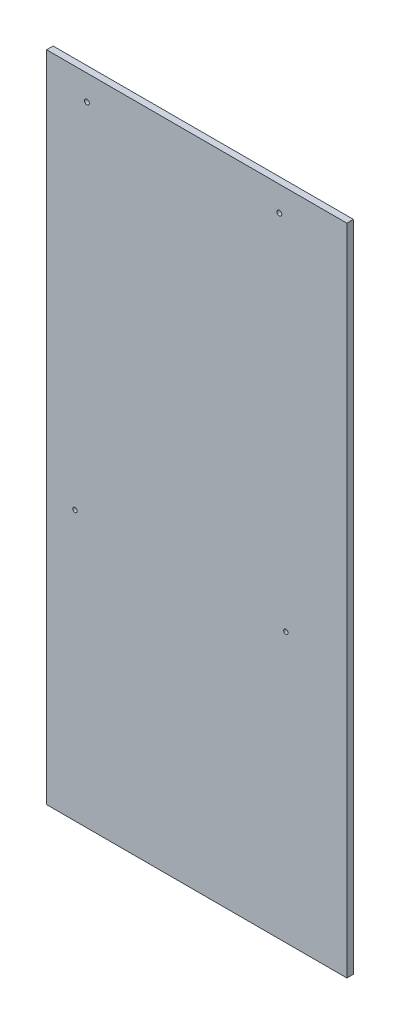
from build123d import *

# Parameters (mm, degrees)
SKETCH2_W           = 350.012
SKETCH2_H           = 762
BOSS_EXTRUDE2_DEPTH = 7.62
SKETCH3_R           = 2.8575
CUT_EXTRUDE1_DEPTH  = 7.62
SKETCH4_R           = 2.54
CUT_EXTRUDE2_DEPTH  = 420.340153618
SKETCH5_R           = 2.54
CUT_EXTRUDE3_DEPTH  = 420.340153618


with BuildPart() as part:
    # Sketch2 → Boss-Extrude2 (new body)
    with BuildSketch(Plane.XY):
        Rectangle(SKETCH2_W, SKETCH2_H)
    extrude(amount=BOSS_EXTRUDE2_DEPTH)

    # Sketch3 → Cut-Extrude1 (cut)
    with BuildSketch(Plane.XY.offset(7.62)):
        with Locations((-128.016, 351.79)):
            Circle(SKETCH3_R)
        with Locations((96.266, 351.79)):
            Circle(SKETCH3_R)
    extrude(amount=-CUT_EXTRUDE1_DEPTH, mode=Mode.SUBTRACT)

    # Sketch4 → Cut-Extrude2 (cut, through all)
    with BuildSketch(Plane.XY.offset(7.62)):
        with Locations((-141.986, -67.056)):
            Circle(SKETCH4_R)
    extrude(amount=-CUT_EXTRUDE2_DEPTH, mode=Mode.SUBTRACT)

    # Sketch5 → Cut-Extrude3 (cut, through all)
    with BuildSketch(Plane.XY.offset(7.62)):
        with Locations((103.886, -67.056)):
            Circle(SKETCH5_R)
    extrude(amount=-CUT_EXTRUDE3_DEPTH, mode=Mode.SUBTRACT)


solid = part.part
